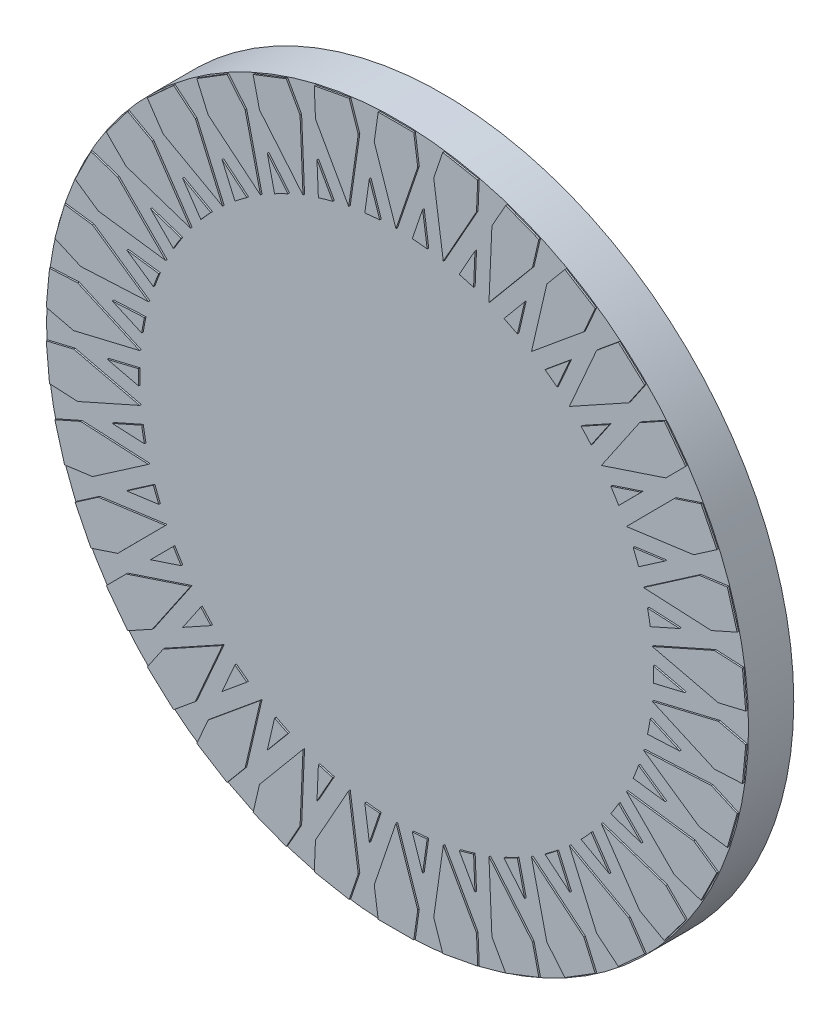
from build123d import *

# Parameters (mm, degrees)
ESQUISSE2_R                     = 22.5
BOSS_EXTRU_1_DEPTH              = 3
ESQUISSE3_R                     = 16.5
ENL_V_MAT_EXTRU_1_DEPTH         = 0.1
ENL_V_DE_MAT_EXTRU_MINCE1_DEPTH = 0.1


with BuildPart() as part:
    # Esquisse2 → Boss.-Extru.1 (new body)
    with BuildSketch(Plane.XY):
        Circle(ESQUISSE2_R)
    extrude(amount=BOSS_EXTRU_1_DEPTH)

    # Esquisse3 → Enl_v. mat.-Extru.1 (cut)
    with BuildSketch(Plane.XY.offset(3)):
        Circle(ESQUISSE3_R)
    extrude(amount=-ENL_V_MAT_EXTRU_1_DEPTH, mode=Mode.SUBTRACT)

    # Esquisse4 → Enl_v. de mat.-Extru.-Mince1 (cut)
    # profile 1 of 34: a face of its own
    with BuildSketch(Plane.XY.offset(3)):
        Polygon((-3.394047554, 23.410934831), (3.394047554, 23.410934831), (0, 13.379937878), align=None)
        Polygon((-2, 22.410934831), (2, 22.410934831), (0, 16.5), align=None, mode=Mode.SUBTRACT)
    # profile 2 of 34: a face of its own
    with BuildSketch(Plane.XY.offset(3)):
        Polygon((0.965490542, 23.635973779), (7.638005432, 22.388664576), (2.458557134, 13.15211901), align=None)
        Polygon((2.15205227, 22.396845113), (6.083944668, 21.661847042), (3.031867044, 16.219056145), align=None, mode=Mode.SUBTRACT)
    # profile 3 of 34: a face of its own
    with BuildSketch(Plane.XY.offset(3)):
        Polygon((5.292150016, 23.056117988), (11.621860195, 20.603975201), (4.833391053, 12.476420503), align=None)
        Polygon((6.23081898, 21.620057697), (9.960707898, 20.175091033), (5.960487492, 15.385791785), align=None, mode=Mode.SUBTRACT)
    # profile 4 of 34: a face of its own
    with BuildSketch(Plane.XY.offset(3)):
        Polygon((9.438591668, 21.691113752), (15.209946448, 18.117642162), (7.043629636, 11.375852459), align=None)
        Polygon((10.097402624, 20.107025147), (13.498271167, 18.001296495), (8.686130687, 14.02858274), align=None, mode=Mode.SUBTRACT)
    # profile 5 of 34: a face of its own
    with BuildSketch(Plane.XY.offset(3)):
        Polygon((13.263613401, 19.587444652), (18.280076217, 15.014334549), (9.014005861, 9.887893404), align=None)
        Polygon((13.620131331, 17.909271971), (16.576167, 15.214489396), (11.11597812, 12.193647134), align=None, mode=Mode.SUBTRACT)
    # profile 6 of 34: a face of its own
    with BuildSketch(Plane.XY.offset(3)):
        Polygon((16.636958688, 16.816748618), (20.727699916, 11.399731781), (10.677420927, 8.063213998), align=None)
        Polygon((16.679042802, 15.101640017), (19.089581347, 11.909571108), (13.16728425, 9.9434715), align=None, mode=Mode.SUBTRACT)
    # profile 7 of 34: a face of its own
    with BuildSketch(Plane.XY.offset(3)):
        Polygon((19.443752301, 13.473378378), (22.469466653, 7.396924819), (11.977229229, 5.96395151), align=None)
        Polygon((19.169969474, 11.779739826), (20.952922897, 8.19908666), (14.770194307, 7.35468287), align=None, mode=Mode.SUBTRACT)
    # profile 8 of 34: a face of its own
    with BuildSketch(Plane.XY.offset(3)):
        Polygon((21.588412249, 9.671188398), (23.446062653, 3.142224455), (12.869167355, 3.661593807), align=None)
        Polygon((21.008085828, 8.056694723), (22.102737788, 4.20939215), (15.870123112, 4.515439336), align=None, mode=Mode.SUBTRACT)
    # profile 9 of 34: a face of its own
    with BuildSketch(Plane.XY.offset(3)):
        Polygon((22.99790471, 5.539657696), (23.62423111, -1.219480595), (13.322861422, 1.234544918), align=None)
        Polygon((22.130797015, 4.059288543), (22.499870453, 0.076351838), (16.429613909, 1.522427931), align=None, mode=Mode.SUBTRACT)
    # profile 10 of 34: a face of its own
    with BuildSketch(Plane.XY.offset(3)):
        Polygon((23.62423111, 1.219480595), (22.99790471, -5.539657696), (13.322861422, -1.234544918), align=None)
        Polygon((22.499870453, -0.076351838), (22.130797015, -4.059288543), (16.429613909, -1.522427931), align=None, mode=Mode.SUBTRACT)
    # profile 11 of 34: a face of its own
    with BuildSketch(Plane.XY.offset(3)):
        Polygon((23.446062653, -3.142224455), (21.588412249, -9.671188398), (12.869167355, -3.661593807), align=None)
        Polygon((22.102737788, -4.20939215), (21.008085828, -8.056694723), (15.870123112, -4.515439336), align=None, mode=Mode.SUBTRACT)
    # profile 12 of 34: a face of its own
    with BuildSketch(Plane.XY.offset(3)):
        Polygon((22.469466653, -7.396924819), (19.443752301, -13.473378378), (11.977229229, -5.96395151), align=None)
        Polygon((20.952922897, -8.19908666), (19.169969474, -11.779739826), (14.770194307, -7.35468287), align=None, mode=Mode.SUBTRACT)
    # profile 13 of 34: a face of its own
    with BuildSketch(Plane.XY.offset(3)):
        Polygon((20.727699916, -11.399731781), (16.636958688, -16.816748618), (10.677420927, -8.063213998), align=None)
        Polygon((19.089581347, -11.909571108), (16.679042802, -15.101640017), (13.16728425, -9.9434715), align=None, mode=Mode.SUBTRACT)
    # profile 14 of 34: a face of its own
    with BuildSketch(Plane.XY.offset(3)):
        Polygon((18.280076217, -15.014334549), (13.263613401, -19.587444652), (9.014005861, -9.887893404), align=None)
        Polygon((16.576167, -15.214489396), (13.620131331, -17.909271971), (11.11597812, -12.193647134), align=None, mode=Mode.SUBTRACT)
    # profile 15 of 34: a face of its own
    with BuildSketch(Plane.XY.offset(3)):
        Polygon((15.209946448, -18.117642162), (9.438591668, -21.691113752), (7.043629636, -11.375852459), align=None)
        Polygon((13.498271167, -18.001296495), (10.097402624, -20.107025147), (8.686130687, -14.02858274), align=None, mode=Mode.SUBTRACT)
    # profile 16 of 34: a face of its own
    with BuildSketch(Plane.XY.offset(3)):
        Polygon((11.621860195, -20.603975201), (5.292150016, -23.056117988), (4.833391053, -12.476420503), align=None)
        Polygon((9.960707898, -20.175091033), (6.23081898, -21.620057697), (5.960487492, -15.385791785), align=None, mode=Mode.SUBTRACT)
    # profile 17 of 34: a face of its own
    with BuildSketch(Plane.XY.offset(3)):
        Polygon((7.638005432, -22.388664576), (0.965490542, -23.635973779), (2.458557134, -13.15211901), align=None)
        Polygon((6.083944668, -21.661847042), (2.15205227, -22.396845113), (3.031867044, -16.219056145), align=None, mode=Mode.SUBTRACT)
    # profile 18 of 34: a face of its own
    with BuildSketch(Plane.XY.offset(3)):
        Polygon((3.394047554, -23.410934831), (-3.394047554, -23.410934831), (0, -13.379937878), align=None)
        Polygon((2, -22.410934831), (-2, -22.410934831), (0, -16.5), align=None, mode=Mode.SUBTRACT)
    # profile 19 of 34: a face of its own
    with BuildSketch(Plane.XY.offset(3)):
        Polygon((-0.965490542, -23.635973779), (-7.638005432, -22.388664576), (-2.458557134, -13.15211901), align=None)
        Polygon((-2.15205227, -22.396845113), (-6.083944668, -21.661847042), (-3.031867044, -16.219056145), align=None, mode=Mode.SUBTRACT)
    # profile 20 of 34: a face of its own
    with BuildSketch(Plane.XY.offset(3)):
        Polygon((-5.292150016, -23.056117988), (-11.621860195, -20.603975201), (-4.833391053, -12.476420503), align=None)
        Polygon((-6.23081898, -21.620057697), (-9.960707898, -20.175091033), (-5.960487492, -15.385791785), align=None, mode=Mode.SUBTRACT)
    # profile 21 of 34: a face of its own
    with BuildSketch(Plane.XY.offset(3)):
        Polygon((-9.438591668, -21.691113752), (-15.209946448, -18.117642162), (-7.043629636, -11.375852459), align=None)
        Polygon((-10.097402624, -20.107025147), (-13.498271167, -18.001296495), (-8.686130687, -14.02858274), align=None, mode=Mode.SUBTRACT)
    # profile 22 of 34: a face of its own
    with BuildSketch(Plane.XY.offset(3)):
        Polygon((-13.263613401, -19.587444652), (-18.280076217, -15.014334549), (-9.014005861, -9.887893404), align=None)
        Polygon((-13.620131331, -17.909271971), (-16.576167, -15.214489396), (-11.11597812, -12.193647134), align=None, mode=Mode.SUBTRACT)
    # profile 23 of 34: a face of its own
    with BuildSketch(Plane.XY.offset(3)):
        Polygon((-16.636958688, -16.816748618), (-20.727699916, -11.399731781), (-10.677420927, -8.063213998), align=None)
        Polygon((-16.679042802, -15.101640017), (-19.089581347, -11.909571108), (-13.16728425, -9.9434715), align=None, mode=Mode.SUBTRACT)
    # profile 24 of 34: a face of its own
    with BuildSketch(Plane.XY.offset(3)):
        Polygon((-19.443752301, -13.473378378), (-22.469466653, -7.396924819), (-11.977229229, -5.96395151), align=None)
        Polygon((-19.169969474, -11.779739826), (-20.952922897, -8.19908666), (-14.770194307, -7.35468287), align=None, mode=Mode.SUBTRACT)
    # profile 25 of 34: a face of its own
    with BuildSketch(Plane.XY.offset(3)):
        Polygon((-21.588412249, -9.671188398), (-23.446062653, -3.142224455), (-12.869167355, -3.661593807), align=None)
        Polygon((-21.008085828, -8.056694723), (-22.102737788, -4.20939215), (-15.870123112, -4.515439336), align=None, mode=Mode.SUBTRACT)
    # profile 26 of 34: a face of its own
    with BuildSketch(Plane.XY.offset(3)):
        Polygon((-22.99790471, -5.539657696), (-23.62423111, 1.219480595), (-13.322861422, -1.234544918), align=None)
        Polygon((-22.130797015, -4.059288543), (-22.499870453, -0.076351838), (-16.429613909, -1.522427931), align=None, mode=Mode.SUBTRACT)
    # profile 27 of 34: a face of its own
    with BuildSketch(Plane.XY.offset(3)):
        Polygon((-23.62423111, -1.219480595), (-22.99790471, 5.539657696), (-13.322861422, 1.234544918), align=None)
        Polygon((-22.499870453, 0.076351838), (-22.130797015, 4.059288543), (-16.429613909, 1.522427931), align=None, mode=Mode.SUBTRACT)
    # profile 28 of 34: a face of its own
    with BuildSketch(Plane.XY.offset(3)):
        Polygon((-23.446062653, 3.142224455), (-21.588412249, 9.671188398), (-12.869167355, 3.661593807), align=None)
        Polygon((-22.102737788, 4.20939215), (-21.008085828, 8.056694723), (-15.870123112, 4.515439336), align=None, mode=Mode.SUBTRACT)
    # profile 29 of 34: a face of its own
    with BuildSketch(Plane.XY.offset(3)):
        Polygon((-22.469466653, 7.396924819), (-19.443752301, 13.473378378), (-11.977229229, 5.96395151), align=None)
        Polygon((-20.952922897, 8.19908666), (-19.169969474, 11.779739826), (-14.770194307, 7.35468287), align=None, mode=Mode.SUBTRACT)
    # profile 30 of 34: a face of its own
    with BuildSketch(Plane.XY.offset(3)):
        Polygon((-20.727699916, 11.399731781), (-16.636958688, 16.816748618), (-10.677420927, 8.063213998), align=None)
        Polygon((-19.089581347, 11.909571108), (-16.679042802, 15.101640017), (-13.16728425, 9.9434715), align=None, mode=Mode.SUBTRACT)
    # profile 31 of 34: a face of its own
    with BuildSketch(Plane.XY.offset(3)):
        Polygon((-18.280076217, 15.014334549), (-13.263613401, 19.587444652), (-9.014005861, 9.887893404), align=None)
        Polygon((-16.576167, 15.214489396), (-13.620131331, 17.909271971), (-11.11597812, 12.193647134), align=None, mode=Mode.SUBTRACT)
    # profile 32 of 34: a face of its own
    with BuildSketch(Plane.XY.offset(3)):
        Polygon((-15.209946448, 18.117642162), (-9.438591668, 21.691113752), (-7.043629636, 11.375852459), align=None)
        Polygon((-13.498271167, 18.001296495), (-10.097402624, 20.107025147), (-8.686130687, 14.02858274), align=None, mode=Mode.SUBTRACT)
    # profile 33 of 34: a face of its own
    with BuildSketch(Plane.XY.offset(3)):
        Polygon((-11.621860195, 20.603975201), (-5.292150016, 23.056117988), (-4.833391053, 12.476420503), align=None)
        Polygon((-9.960707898, 20.175091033), (-6.23081898, 21.620057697), (-5.960487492, 15.385791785), align=None, mode=Mode.SUBTRACT)
    # profile 34 of 34: a face of its own
    with BuildSketch(Plane.XY.offset(3)):
        Polygon((-7.638005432, 22.388664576), (-0.965490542, 23.635973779), (-2.458557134, 13.15211901), align=None)
        Polygon((-6.083944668, 21.661847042), (-2.15205227, 22.396845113), (-3.031867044, 16.219056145), align=None, mode=Mode.SUBTRACT)
    extrude(amount=-ENL_V_DE_MAT_EXTRU_MINCE1_DEPTH, mode=Mode.SUBTRACT)


solid = part.part
